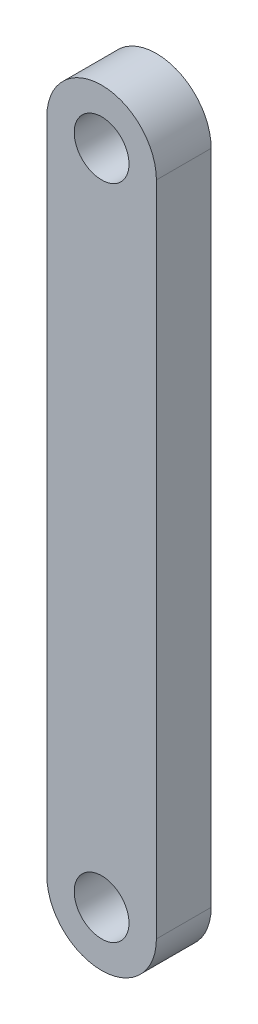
from build123d import *

# Parameters (mm, degrees)
BOSS_EXTRUDE1_DEPTH = 10
SKETCH2_R           = 5
CUT_EXTRUDE1_DEPTH  = 10


with BuildPart() as part:
    # Sketch1 → Boss-Extrude1 (new body)
    with BuildSketch(Plane.XY):
        with BuildLine():
            Line((-10, 60), (-10, -60))
            ThreePointArc((-10, -60), (0, -70), (10, -60))
            Line((10, -60), (10, 60))
            ThreePointArc((10, 60), (0, 70), (-10, 60))
        make_face()
    extrude(amount=BOSS_EXTRUDE1_DEPTH)

    # Sketch2 → Cut-Extrude1 (cut)
    with BuildSketch(Plane.XY):
        with Locations((0, 60)):
            Circle(SKETCH2_R)
        with Locations((0, -60)):
            Circle(SKETCH2_R)
    extrude(amount=CUT_EXTRUDE1_DEPTH, mode=Mode.SUBTRACT)


solid = part.part
